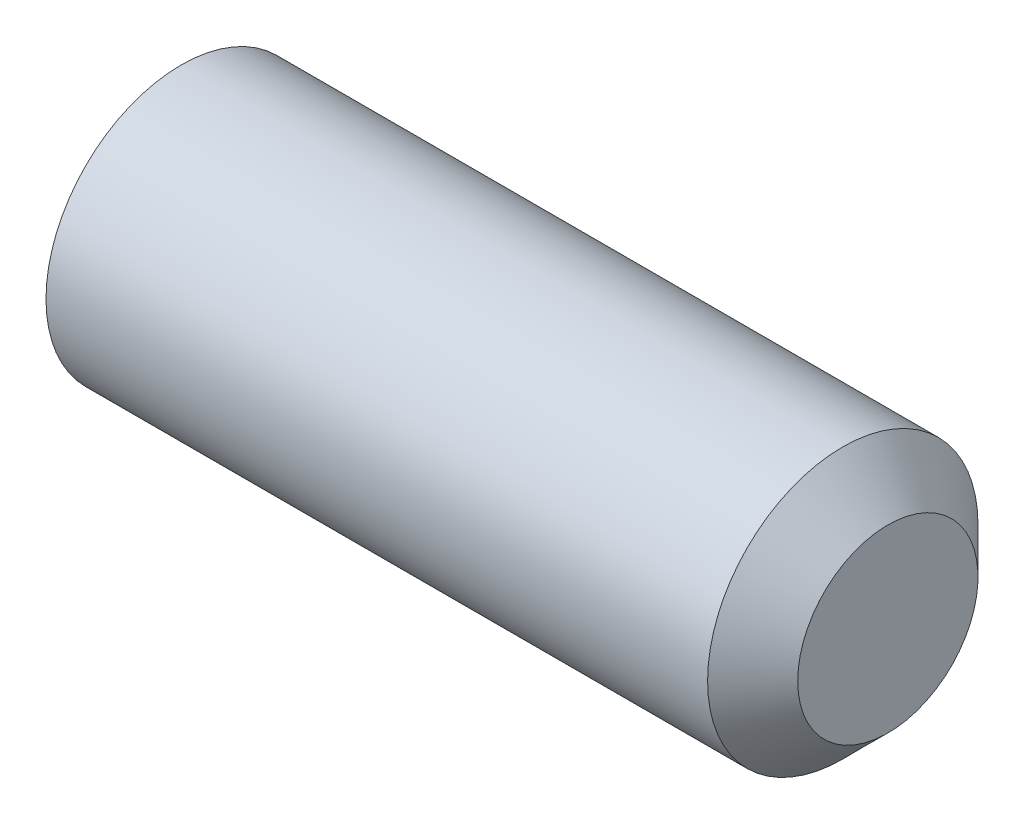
ISO-10303-21;
HEADER;
FILE_DESCRIPTION(('STEP AP214'),'2;1');
FILE_NAME('part.step','',(''),(''),'','','');
FILE_SCHEMA(('AUTOMOTIVE_DESIGN { 1 0 10303 214 1 1 1 1 }'));
ENDSEC;
DATA;
#1=APPLICATION_CONTEXT('core data for automotive mechanical design processes');
#2=APPLICATION_PROTOCOL_DEFINITION('international standard','automotive_design',2000,#1);
#3=PRODUCT_CONTEXT('',#1,'mechanical');
#4=PRODUCT('Part','Part','',(#3));
#5=PRODUCT_RELATED_PRODUCT_CATEGORY('part','',(#4));
#6=PRODUCT_DEFINITION_FORMATION('','',#4);
#7=PRODUCT_DEFINITION_CONTEXT('part definition',#1,'design');
#8=PRODUCT_DEFINITION('design','',#6,#7);
#9=PRODUCT_DEFINITION_SHAPE('','',#8);
#10=(LENGTH_UNIT() NAMED_UNIT(*) SI_UNIT(.MILLI.,.METRE.));
#11=(NAMED_UNIT(*) PLANE_ANGLE_UNIT() SI_UNIT($,.RADIAN.));
#12=(NAMED_UNIT(*) SI_UNIT($,.STERADIAN.) SOLID_ANGLE_UNIT());
#13=UNCERTAINTY_MEASURE_WITH_UNIT(LENGTH_MEASURE(1.E-05),#10,'distance_accuracy_value','');
#14=(GEOMETRIC_REPRESENTATION_CONTEXT(3) GLOBAL_UNCERTAINTY_ASSIGNED_CONTEXT((#13)) GLOBAL_UNIT_ASSIGNED_CONTEXT((#10,
#11,#12)) REPRESENTATION_CONTEXT('',''));
#15=CARTESIAN_POINT('',(0.,0.,0.));
#16=DIRECTION('',(0.,0.,1.));
#17=DIRECTION('',(1.,0.,0.));
#18=AXIS2_PLACEMENT_3D('',#15,#16,#17);
#19=CARTESIAN_POINT('',(0.,0.,0.));
#20=DIRECTION('',(-1.,0.,0.));
#21=DIRECTION('',(0.,0.,1.));
#22=AXIS2_PLACEMENT_3D('',#19,#20,#21);
#23=PLANE('',#22);
#24=CARTESIAN_POINT('',(0.,0.,0.));
#25=DIRECTION('',(-1.,0.,0.));
#26=DIRECTION('',(0.,0.,1.));
#27=AXIS2_PLACEMENT_3D('',#24,#25,#26);
#28=CIRCLE('',#27,2.4455);
#29=CARTESIAN_POINT('',(0.,0.,2.4455));
#30=VERTEX_POINT('',#29);
#31=EDGE_CURVE('E133',#30,#30,#28,.T.);
#32=ORIENTED_EDGE('',*,*,#31,.T.);
#33=EDGE_LOOP('',(#32));
#34=FACE_BOUND('',#33,.T.);
#35=DIRECTION('',(0.,0.,-1.));
#36=VECTOR('',#35,1.);
#37=CARTESIAN_POINT('',(0.,1.5,0.866025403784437));
#38=LINE('',#37,#36);
#39=CARTESIAN_POINT('',(0.,1.5,0.866025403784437));
#40=VERTEX_POINT('',#39);
#41=CARTESIAN_POINT('',(0.,1.5,-0.866025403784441));
#42=VERTEX_POINT('',#41);
#43=EDGE_CURVE('E124',#40,#42,#38,.T.);
#44=ORIENTED_EDGE('',*,*,#43,.F.);
#45=DIRECTION('',(0.,-0.866025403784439,0.5));
#46=VECTOR('',#45,1.);
#47=CARTESIAN_POINT('',(0.,1.5,0.866025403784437));
#48=LINE('',#47,#46);
#49=CARTESIAN_POINT('',(0.,0.,1.73205080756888));
#50=VERTEX_POINT('',#49);
#51=EDGE_CURVE('E46',#40,#50,#48,.T.);
#52=ORIENTED_EDGE('',*,*,#51,.T.);
#53=DIRECTION('',(0.,0.866025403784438,0.5));
#54=VECTOR('',#53,1.);
#55=CARTESIAN_POINT('',(0.,-1.5,0.866025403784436));
#56=LINE('',#55,#54);
#57=CARTESIAN_POINT('',(0.,-1.5,0.866025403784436));
#58=VERTEX_POINT('',#57);
#59=EDGE_CURVE('E115',#58,#50,#56,.T.);
#60=ORIENTED_EDGE('',*,*,#59,.F.);
#61=DIRECTION('',(0.,0.,-1.));
#62=VECTOR('',#61,1.);
#63=CARTESIAN_POINT('',(0.,-1.5,0.866025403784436));
#64=LINE('',#63,#62);
#65=CARTESIAN_POINT('',(0.,-1.5,-0.866025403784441));
#66=VERTEX_POINT('',#65);
#67=EDGE_CURVE('E118',#58,#66,#64,.T.);
#68=ORIENTED_EDGE('',*,*,#67,.T.);
#69=DIRECTION('',(0.,0.866025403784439,-0.5));
#70=VECTOR('',#69,1.);
#71=CARTESIAN_POINT('',(0.,-1.5,-0.866025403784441));
#72=LINE('',#71,#70);
#73=CARTESIAN_POINT('',(0.,0.,-1.73205080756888));
#74=VERTEX_POINT('',#73);
#75=EDGE_CURVE('E121',#66,#74,#72,.T.);
#76=ORIENTED_EDGE('',*,*,#75,.T.);
#77=DIRECTION('',(0.,-0.866025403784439,-0.5));
#78=VECTOR('',#77,1.);
#79=CARTESIAN_POINT('',(0.,1.5,-0.866025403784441));
#80=LINE('',#79,#78);
#81=EDGE_CURVE('E104',#42,#74,#80,.T.);
#82=ORIENTED_EDGE('',*,*,#81,.F.);
#83=EDGE_LOOP('',(#44,#52,#60,#68,#76,#82));
#84=FACE_BOUND('',#83,.T.);
#85=ADVANCED_FACE('F31',(#34,#84),#23,.T.);
#86=CARTESIAN_POINT('',(16.,2.,0.));
#87=DIRECTION('',(1.,0.,0.));
#88=DIRECTION('',(0.,0.,-1.));
#89=AXIS2_PLACEMENT_3D('',#86,#87,#88);
#90=PLANE('',#89);
#91=CARTESIAN_POINT('',(16.,0.,0.));
#92=DIRECTION('',(-1.,0.,0.));
#93=DIRECTION('',(0.,0.,1.));
#94=AXIS2_PLACEMENT_3D('',#91,#92,#93);
#95=CIRCLE('',#94,2.);
#96=CARTESIAN_POINT('',(16.,0.,2.));
#97=VERTEX_POINT('',#96);
#98=EDGE_CURVE('E11',#97,#97,#95,.T.);
#99=ORIENTED_EDGE('',*,*,#98,.F.);
#100=EDGE_LOOP('',(#99));
#101=FACE_BOUND('',#100,.T.);
#102=ADVANCED_FACE('F33',(#101),#90,.T.);
#103=CARTESIAN_POINT('',(15.,0.,0.));
#104=DIRECTION('',(-1.,0.,0.));
#105=DIRECTION('',(0.,0.,1.));
#106=AXIS2_PLACEMENT_3D('',#103,#104,#105);
#107=CONICAL_SURFACE('',#106,3.,0.785398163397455);
#108=ORIENTED_EDGE('',*,*,#98,.T.);
#109=EDGE_LOOP('',(#108));
#110=FACE_BOUND('',#109,.T.);
#111=CARTESIAN_POINT('',(15.,0.,0.));
#112=DIRECTION('',(-1.,0.,0.));
#113=DIRECTION('',(0.,0.,1.));
#114=AXIS2_PLACEMENT_3D('',#111,#112,#113);
#115=CIRCLE('',#114,3.);
#116=CARTESIAN_POINT('',(15.,0.,3.));
#117=VERTEX_POINT('',#116);
#118=EDGE_CURVE('E39',#117,#117,#115,.T.);
#119=ORIENTED_EDGE('',*,*,#118,.F.);
#120=EDGE_LOOP('',(#119));
#121=FACE_BOUND('',#120,.T.);
#122=ADVANCED_FACE('F144',(#110,#121),#107,.T.);
#123=CARTESIAN_POINT('',(-12.7,0.,0.));
#124=DIRECTION('',(-1.,0.,0.));
#125=DIRECTION('',(0.,0.,1.));
#126=AXIS2_PLACEMENT_3D('',#123,#124,#125);
#127=CYLINDRICAL_SURFACE('',#126,3.);
#128=ORIENTED_EDGE('',*,*,#118,.T.);
#129=EDGE_LOOP('',(#128));
#130=FACE_BOUND('',#129,.T.);
#131=CARTESIAN_POINT('',(0.320140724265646,0.,0.));
#132=DIRECTION('',(-1.,0.,0.));
#133=DIRECTION('',(0.,0.,1.));
#134=AXIS2_PLACEMENT_3D('',#131,#132,#133);
#135=CIRCLE('',#134,3.);
#136=CARTESIAN_POINT('',(0.320140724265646,0.,3.));
#137=VERTEX_POINT('',#136);
#138=EDGE_CURVE('E136',#137,#137,#135,.T.);
#139=ORIENTED_EDGE('',*,*,#138,.F.);
#140=EDGE_LOOP('',(#139));
#141=FACE_BOUND('',#140,.T.);
#142=ADVANCED_FACE('F141',(#130,#141),#127,.T.);
#143=CARTESIAN_POINT('',(0.,0.,0.));
#144=DIRECTION('',(1.,0.,0.));
#145=DIRECTION('',(0.,0.,-1.));
#146=AXIS2_PLACEMENT_3D('',#143,#144,#145);
#147=CONICAL_SURFACE('',#146,2.4455,1.0471975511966);
#148=ORIENTED_EDGE('',*,*,#138,.T.);
#149=EDGE_LOOP('',(#148));
#150=FACE_BOUND('',#149,.T.);
#151=ORIENTED_EDGE('',*,*,#31,.F.);
#152=EDGE_LOOP('',(#151));
#153=FACE_BOUND('',#152,.T.);
#154=ADVANCED_FACE('F151',(#150,#153),#147,.T.);
#155=CARTESIAN_POINT('',(3.5,1.5,0.866025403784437));
#156=DIRECTION('',(0.,-0.5,-0.866025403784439));
#157=DIRECTION('',(0.,0.866025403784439,-0.5));
#158=AXIS2_PLACEMENT_3D('',#155,#156,#157);
#159=PLANE('',#158);
#160=ORIENTED_EDGE('',*,*,#51,.F.);
#161=DIRECTION('',(-1.,0.,0.));
#162=VECTOR('',#161,1.);
#163=CARTESIAN_POINT('',(3.5,1.5,0.866025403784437));
#164=LINE('',#163,#162);
#165=CARTESIAN_POINT('',(3.5,1.5,0.866025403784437));
#166=VERTEX_POINT('',#165);
#167=EDGE_CURVE('E51',#166,#40,#164,.T.);
#168=ORIENTED_EDGE('',*,*,#167,.F.);
#169=DIRECTION('',(0.,-0.866025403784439,0.5));
#170=VECTOR('',#169,1.);
#171=CARTESIAN_POINT('',(3.5,1.5,0.866025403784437));
#172=LINE('',#171,#170);
#173=CARTESIAN_POINT('',(3.5,0.,1.73205080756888));
#174=VERTEX_POINT('',#173);
#175=EDGE_CURVE('E78',#166,#174,#172,.T.);
#176=ORIENTED_EDGE('',*,*,#175,.T.);
#177=DIRECTION('',(-1.,0.,0.));
#178=VECTOR('',#177,1.);
#179=CARTESIAN_POINT('',(3.5,0.,1.73205080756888));
#180=LINE('',#179,#178);
#181=EDGE_CURVE('E131',#174,#50,#180,.T.);
#182=ORIENTED_EDGE('',*,*,#181,.T.);
#183=EDGE_LOOP('',(#160,#168,#176,#182));
#184=FACE_BOUND('',#183,.T.);
#185=ADVANCED_FACE('F162',(#184),#159,.T.);
#186=CARTESIAN_POINT('',(3.5,-1.5,0.866025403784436));
#187=DIRECTION('',(0.,-0.5,0.866025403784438));
#188=DIRECTION('',(0.,-0.866025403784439,-0.5));
#189=AXIS2_PLACEMENT_3D('',#186,#187,#188);
#190=PLANE('',#189);
#191=ORIENTED_EDGE('',*,*,#59,.T.);
#192=ORIENTED_EDGE('',*,*,#181,.F.);
#193=DIRECTION('',(0.,0.866025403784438,0.5));
#194=VECTOR('',#193,1.);
#195=CARTESIAN_POINT('',(3.5,-1.5,0.866025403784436));
#196=LINE('',#195,#194);
#197=CARTESIAN_POINT('',(3.5,-1.5,0.866025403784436));
#198=VERTEX_POINT('',#197);
#199=EDGE_CURVE('E260',#198,#174,#196,.T.);
#200=ORIENTED_EDGE('',*,*,#199,.F.);
#201=DIRECTION('',(-1.,0.,0.));
#202=VECTOR('',#201,1.);
#203=CARTESIAN_POINT('',(3.5,-1.5,0.866025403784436));
#204=LINE('',#203,#202);
#205=EDGE_CURVE('E129',#198,#58,#204,.T.);
#206=ORIENTED_EDGE('',*,*,#205,.T.);
#207=EDGE_LOOP('',(#191,#192,#200,#206));
#208=FACE_BOUND('',#207,.T.);
#209=ADVANCED_FACE('F169',(#208),#190,.F.);
#210=CARTESIAN_POINT('',(3.5,-1.5,0.866025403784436));
#211=DIRECTION('',(0.,1.,0.));
#212=DIRECTION('',(0.,0.,1.));
#213=AXIS2_PLACEMENT_3D('',#210,#211,#212);
#214=PLANE('',#213);
#215=ORIENTED_EDGE('',*,*,#67,.F.);
#216=ORIENTED_EDGE('',*,*,#205,.F.);
#217=DIRECTION('',(0.,0.,-1.));
#218=VECTOR('',#217,1.);
#219=CARTESIAN_POINT('',(3.5,-1.5,0.866025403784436));
#220=LINE('',#219,#218);
#221=CARTESIAN_POINT('',(3.5,-1.5,-0.866025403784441));
#222=VERTEX_POINT('',#221);
#223=EDGE_CURVE('E99',#198,#222,#220,.T.);
#224=ORIENTED_EDGE('',*,*,#223,.T.);
#225=DIRECTION('',(-1.,0.,0.));
#226=VECTOR('',#225,1.);
#227=CARTESIAN_POINT('',(3.5,-1.5,-0.866025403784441));
#228=LINE('',#227,#226);
#229=EDGE_CURVE('E94',#222,#66,#228,.T.);
#230=ORIENTED_EDGE('',*,*,#229,.T.);
#231=EDGE_LOOP('',(#215,#216,#224,#230));
#232=FACE_BOUND('',#231,.T.);
#233=ADVANCED_FACE('F176',(#232),#214,.T.);
#234=CARTESIAN_POINT('',(3.5,-1.5,-0.866025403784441));
#235=DIRECTION('',(0.,0.5,0.866025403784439));
#236=DIRECTION('',(0.,-0.866025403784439,0.5));
#237=AXIS2_PLACEMENT_3D('',#234,#235,#236);
#238=PLANE('',#237);
#239=ORIENTED_EDGE('',*,*,#75,.F.);
#240=ORIENTED_EDGE('',*,*,#229,.F.);
#241=DIRECTION('',(0.,0.866025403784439,-0.5));
#242=VECTOR('',#241,1.);
#243=CARTESIAN_POINT('',(3.5,-1.5,-0.866025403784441));
#244=LINE('',#243,#242);
#245=CARTESIAN_POINT('',(3.5,0.,-1.73205080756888));
#246=VERTEX_POINT('',#245);
#247=EDGE_CURVE('E89',#222,#246,#244,.T.);
#248=ORIENTED_EDGE('',*,*,#247,.T.);
#249=DIRECTION('',(-1.,0.,0.));
#250=VECTOR('',#249,1.);
#251=CARTESIAN_POINT('',(3.5,0.,-1.73205080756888));
#252=LINE('',#251,#250);
#253=EDGE_CURVE('E93',#246,#74,#252,.T.);
#254=ORIENTED_EDGE('',*,*,#253,.T.);
#255=EDGE_LOOP('',(#239,#240,#248,#254));
#256=FACE_BOUND('',#255,.T.);
#257=ADVANCED_FACE('F92',(#256),#238,.T.);
#258=CARTESIAN_POINT('',(3.5,1.5,-0.866025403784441));
#259=DIRECTION('',(0.,0.5,-0.866025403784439));
#260=DIRECTION('',(0.,0.866025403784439,0.5));
#261=AXIS2_PLACEMENT_3D('',#258,#259,#260);
#262=PLANE('',#261);
#263=ORIENTED_EDGE('',*,*,#81,.T.);
#264=ORIENTED_EDGE('',*,*,#253,.F.);
#265=DIRECTION('',(0.,-0.866025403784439,-0.5));
#266=VECTOR('',#265,1.);
#267=CARTESIAN_POINT('',(3.5,1.5,-0.866025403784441));
#268=LINE('',#267,#266);
#269=CARTESIAN_POINT('',(3.5,1.5,-0.866025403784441));
#270=VERTEX_POINT('',#269);
#271=EDGE_CURVE('E98',#270,#246,#268,.T.);
#272=ORIENTED_EDGE('',*,*,#271,.F.);
#273=DIRECTION('',(-1.,0.,0.));
#274=VECTOR('',#273,1.);
#275=CARTESIAN_POINT('',(3.5,1.5,-0.866025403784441));
#276=LINE('',#275,#274);
#277=EDGE_CURVE('E74',#270,#42,#276,.T.);
#278=ORIENTED_EDGE('',*,*,#277,.T.);
#279=EDGE_LOOP('',(#263,#264,#272,#278));
#280=FACE_BOUND('',#279,.T.);
#281=ADVANCED_FACE('F101',(#280),#262,.F.);
#282=CARTESIAN_POINT('',(3.5,1.5,0.866025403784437));
#283=DIRECTION('',(0.,1.,0.));
#284=DIRECTION('',(0.,0.,1.));
#285=AXIS2_PLACEMENT_3D('',#282,#283,#284);
#286=PLANE('',#285);
#287=ORIENTED_EDGE('',*,*,#43,.T.);
#288=ORIENTED_EDGE('',*,*,#277,.F.);
#289=DIRECTION('',(0.,0.,-1.));
#290=VECTOR('',#289,1.);
#291=CARTESIAN_POINT('',(3.5,1.5,0.866025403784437));
#292=LINE('',#291,#290);
#293=EDGE_CURVE('E109',#166,#270,#292,.T.);
#294=ORIENTED_EDGE('',*,*,#293,.F.);
#295=ORIENTED_EDGE('',*,*,#167,.T.);
#296=EDGE_LOOP('',(#287,#288,#294,#295));
#297=FACE_BOUND('',#296,.T.);
#298=ADVANCED_FACE('F188',(#297),#286,.F.);
#299=CARTESIAN_POINT('',(3.5,-1.5,2.59807621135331));
#300=DIRECTION('',(1.,0.,0.));
#301=DIRECTION('',(0.,0.,-1.));
#302=AXIS2_PLACEMENT_3D('',#299,#300,#301);
#303=PLANE('',#302);
#304=ORIENTED_EDGE('',*,*,#175,.F.);
#305=ORIENTED_EDGE('',*,*,#293,.T.);
#306=ORIENTED_EDGE('',*,*,#271,.T.);
#307=ORIENTED_EDGE('',*,*,#247,.F.);
#308=ORIENTED_EDGE('',*,*,#223,.F.);
#309=ORIENTED_EDGE('',*,*,#199,.T.);
#310=EDGE_LOOP('',(#304,#305,#306,#307,#308,#309));
#311=FACE_BOUND('',#310,.T.);
#312=ADVANCED_FACE('F107',(#311),#303,.F.);
#313=CLOSED_SHELL('',(#85,#102,#122,#142,#154,#185,#209,#233,#257,#281,#298,#312));
#314=MANIFOLD_SOLID_BREP('B2',#313);
#315=ADVANCED_BREP_SHAPE_REPRESENTATION('',(#18,#314),#14);
#316=SHAPE_DEFINITION_REPRESENTATION(#9,#315);
ENDSEC;
END-ISO-10303-21;
